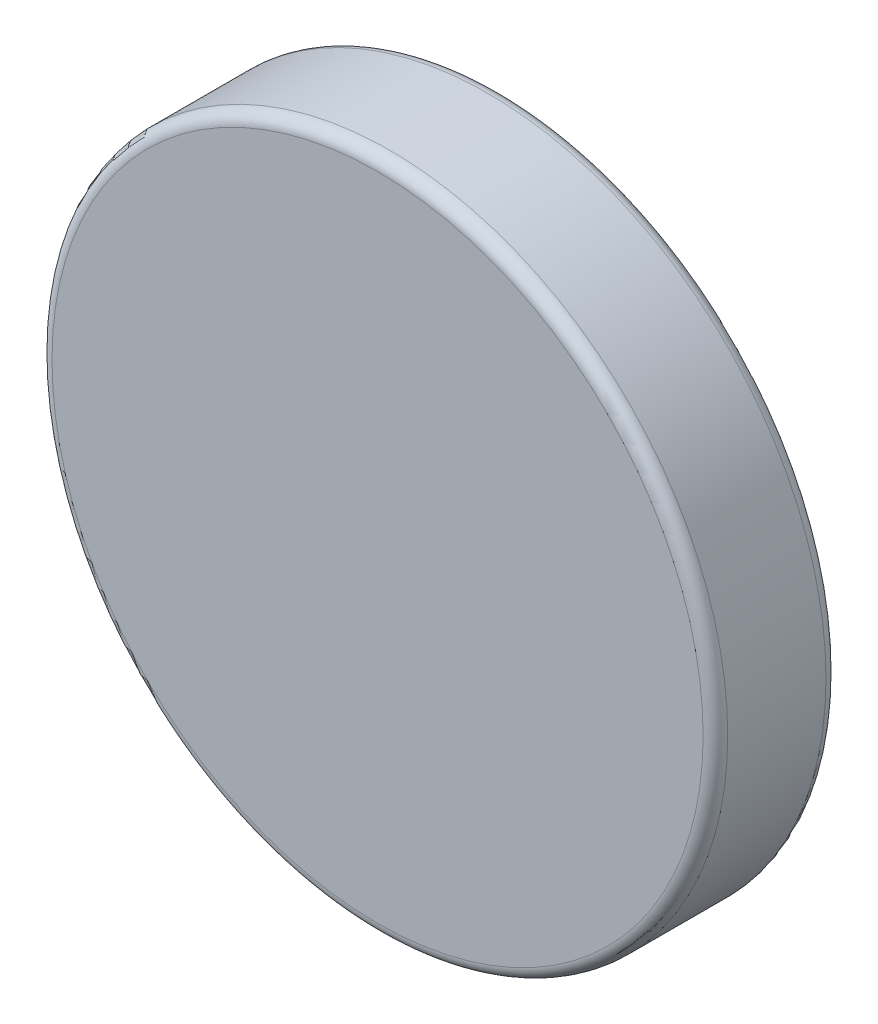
ISO-10303-21;
HEADER;
FILE_DESCRIPTION(('STEP AP214'),'2;1');
FILE_NAME('part.step','',(''),(''),'','','');
FILE_SCHEMA(('AUTOMOTIVE_DESIGN { 1 0 10303 214 1 1 1 1 }'));
ENDSEC;
DATA;
#1=APPLICATION_CONTEXT('core data for automotive mechanical design processes');
#2=APPLICATION_PROTOCOL_DEFINITION('international standard','automotive_design',2000,#1);
#3=PRODUCT_CONTEXT('',#1,'mechanical');
#4=PRODUCT('Part','Part','',(#3));
#5=PRODUCT_RELATED_PRODUCT_CATEGORY('part','',(#4));
#6=PRODUCT_DEFINITION_FORMATION('','',#4);
#7=PRODUCT_DEFINITION_CONTEXT('part definition',#1,'design');
#8=PRODUCT_DEFINITION('design','',#6,#7);
#9=PRODUCT_DEFINITION_SHAPE('','',#8);
#10=(LENGTH_UNIT() NAMED_UNIT(*) SI_UNIT(.MILLI.,.METRE.));
#11=(NAMED_UNIT(*) PLANE_ANGLE_UNIT() SI_UNIT($,.RADIAN.));
#12=(NAMED_UNIT(*) SI_UNIT($,.STERADIAN.) SOLID_ANGLE_UNIT());
#13=UNCERTAINTY_MEASURE_WITH_UNIT(LENGTH_MEASURE(1.E-05),#10,'distance_accuracy_value','');
#14=(GEOMETRIC_REPRESENTATION_CONTEXT(3) GLOBAL_UNCERTAINTY_ASSIGNED_CONTEXT((#13)) GLOBAL_UNIT_ASSIGNED_CONTEXT((#10,
#11,#12)) REPRESENTATION_CONTEXT('',''));
#15=CARTESIAN_POINT('',(0.,0.,0.));
#16=DIRECTION('',(0.,0.,1.));
#17=DIRECTION('',(1.,0.,0.));
#18=AXIS2_PLACEMENT_3D('',#15,#16,#17);
#19=CARTESIAN_POINT('',(0.,0.,1.));
#20=DIRECTION('',(0.,0.,-1.));
#21=DIRECTION('',(-1.,0.,0.));
#22=AXIS2_PLACEMENT_3D('',#19,#20,#21);
#23=CYLINDRICAL_SURFACE('',#22,2.75);
#24=CARTESIAN_POINT('',(0.,0.,0.9));
#25=DIRECTION('',(0.,0.,1.));
#26=DIRECTION('',(1.,0.,0.));
#27=AXIS2_PLACEMENT_3D('',#24,#25,#26);
#28=CIRCLE('',#27,2.75);
#29=CARTESIAN_POINT('',(2.75,0.,0.9));
#30=VERTEX_POINT('',#29);
#31=EDGE_CURVE('E10',#30,#30,#28,.F.);
#32=ORIENTED_EDGE('',*,*,#31,.T.);
#33=EDGE_LOOP('',(#32));
#34=FACE_BOUND('',#33,.T.);
#35=CARTESIAN_POINT('',(0.,0.,0.1));
#36=DIRECTION('',(0.,0.,1.));
#37=DIRECTION('',(1.,0.,0.));
#38=AXIS2_PLACEMENT_3D('',#35,#36,#37);
#39=CIRCLE('',#38,2.75);
#40=CARTESIAN_POINT('',(2.75,0.,0.1));
#41=VERTEX_POINT('',#40);
#42=EDGE_CURVE('E51',#41,#41,#39,.T.);
#43=ORIENTED_EDGE('',*,*,#42,.T.);
#44=EDGE_LOOP('',(#43));
#45=FACE_BOUND('',#44,.T.);
#46=ADVANCED_FACE('F43',(#34,#45),#23,.T.);
#47=CARTESIAN_POINT('',(0.,0.,1.));
#48=DIRECTION('',(0.,0.,1.));
#49=DIRECTION('',(1.,0.,0.));
#50=AXIS2_PLACEMENT_3D('',#47,#48,#49);
#51=PLANE('',#50);
#52=CARTESIAN_POINT('',(0.,0.,1.));
#53=DIRECTION('',(0.,0.,1.));
#54=DIRECTION('',(1.,0.,0.));
#55=AXIS2_PLACEMENT_3D('',#52,#53,#54);
#56=CIRCLE('',#55,2.65);
#57=CARTESIAN_POINT('',(2.65,0.,1.));
#58=VERTEX_POINT('',#57);
#59=EDGE_CURVE('E56',#58,#58,#56,.T.);
#60=ORIENTED_EDGE('',*,*,#59,.T.);
#61=EDGE_LOOP('',(#60));
#62=FACE_BOUND('',#61,.T.);
#63=ADVANCED_FACE('F94',(#62),#51,.T.);
#64=CARTESIAN_POINT('',(0.,0.,0.));
#65=DIRECTION('',(0.,0.,1.));
#66=DIRECTION('',(1.,0.,0.));
#67=AXIS2_PLACEMENT_3D('',#64,#65,#66);
#68=PLANE('',#67);
#69=CARTESIAN_POINT('',(0.,0.,0.));
#70=DIRECTION('',(0.,0.,1.));
#71=DIRECTION('',(1.,0.,0.));
#72=AXIS2_PLACEMENT_3D('',#69,#70,#71);
#73=CIRCLE('',#72,2.35);
#74=CARTESIAN_POINT('',(2.35,0.,0.));
#75=VERTEX_POINT('',#74);
#76=EDGE_CURVE('E61',#75,#75,#73,.T.);
#77=ORIENTED_EDGE('',*,*,#76,.T.);
#78=EDGE_LOOP('',(#77));
#79=FACE_BOUND('',#78,.T.);
#80=CARTESIAN_POINT('',(0.,0.,0.));
#81=DIRECTION('',(0.,0.,1.));
#82=DIRECTION('',(1.,0.,0.));
#83=AXIS2_PLACEMENT_3D('',#80,#81,#82);
#84=CIRCLE('',#83,2.65);
#85=CARTESIAN_POINT('',(2.65,0.,0.));
#86=VERTEX_POINT('',#85);
#87=EDGE_CURVE('E67',#86,#86,#84,.F.);
#88=ORIENTED_EDGE('',*,*,#87,.T.);
#89=EDGE_LOOP('',(#88));
#90=FACE_BOUND('',#89,.T.);
#91=ADVANCED_FACE('F84',(#79,#90),#68,.F.);
#92=CARTESIAN_POINT('',(0.,0.,0.8));
#93=DIRECTION('',(0.,0.,-1.));
#94=DIRECTION('',(-1.,0.,0.));
#95=AXIS2_PLACEMENT_3D('',#92,#93,#94);
#96=CYLINDRICAL_SURFACE('',#95,2.25);
#97=CARTESIAN_POINT('',(0.,0.,0.1));
#98=DIRECTION('',(0.,0.,1.));
#99=DIRECTION('',(1.,0.,0.));
#100=AXIS2_PLACEMENT_3D('',#97,#98,#99);
#101=CIRCLE('',#100,2.25);
#102=CARTESIAN_POINT('',(2.25,0.,0.1));
#103=VERTEX_POINT('',#102);
#104=EDGE_CURVE('E71',#103,#103,#101,.F.);
#105=ORIENTED_EDGE('',*,*,#104,.T.);
#106=EDGE_LOOP('',(#105));
#107=FACE_BOUND('',#106,.T.);
#108=CARTESIAN_POINT('',(0.,0.,0.8));
#109=DIRECTION('',(0.,0.,-1.));
#110=DIRECTION('',(-1.,0.,0.));
#111=AXIS2_PLACEMENT_3D('',#108,#109,#110);
#112=CIRCLE('',#111,2.25);
#113=CARTESIAN_POINT('',(-2.25,0.,0.8));
#114=VERTEX_POINT('',#113);
#115=EDGE_CURVE('E75',#114,#114,#112,.T.);
#116=ORIENTED_EDGE('',*,*,#115,.F.);
#117=EDGE_LOOP('',(#116));
#118=FACE_BOUND('',#117,.T.);
#119=ADVANCED_FACE('F82',(#107,#118),#96,.F.);
#120=CARTESIAN_POINT('',(0.,0.,0.8));
#121=DIRECTION('',(0.,0.,-1.));
#122=DIRECTION('',(-1.,0.,0.));
#123=AXIS2_PLACEMENT_3D('',#120,#121,#122);
#124=PLANE('',#123);
#125=ORIENTED_EDGE('',*,*,#115,.T.);
#126=EDGE_LOOP('',(#125));
#127=FACE_BOUND('',#126,.T.);
#128=ADVANCED_FACE('F80',(#127),#124,.T.);
#129=CARTESIAN_POINT('',(0.,0.,0.1));
#130=DIRECTION('',(0.,0.,1.));
#131=DIRECTION('',(1.,0.,0.));
#132=AXIS2_PLACEMENT_3D('',#129,#130,#131);
#133=TOROIDAL_SURFACE('',#132,2.35,0.1);
#134=ORIENTED_EDGE('',*,*,#76,.F.);
#135=EDGE_LOOP('',(#134));
#136=FACE_BOUND('',#135,.T.);
#137=ORIENTED_EDGE('',*,*,#104,.F.);
#138=EDGE_LOOP('',(#137));
#139=FACE_BOUND('',#138,.T.);
#140=ADVANCED_FACE('F92',(#136,#139),#133,.T.);
#141=CARTESIAN_POINT('',(0.,0.,0.9));
#142=DIRECTION('',(0.,0.,1.));
#143=DIRECTION('',(1.,0.,0.));
#144=AXIS2_PLACEMENT_3D('',#141,#142,#143);
#145=TOROIDAL_SURFACE('',#144,2.65,0.1);
#146=ORIENTED_EDGE('',*,*,#31,.F.);
#147=EDGE_LOOP('',(#146));
#148=FACE_BOUND('',#147,.T.);
#149=ORIENTED_EDGE('',*,*,#59,.F.);
#150=EDGE_LOOP('',(#149));
#151=FACE_BOUND('',#150,.T.);
#152=ADVANCED_FACE('F105',(#148,#151),#145,.T.);
#153=CARTESIAN_POINT('',(0.,0.,0.1));
#154=DIRECTION('',(0.,0.,1.));
#155=DIRECTION('',(1.,0.,0.));
#156=AXIS2_PLACEMENT_3D('',#153,#154,#155);
#157=TOROIDAL_SURFACE('',#156,2.65,0.1);
#158=ORIENTED_EDGE('',*,*,#87,.F.);
#159=EDGE_LOOP('',(#158));
#160=FACE_BOUND('',#159,.T.);
#161=ORIENTED_EDGE('',*,*,#42,.F.);
#162=EDGE_LOOP('',(#161));
#163=FACE_BOUND('',#162,.T.);
#164=ADVANCED_FACE('F45',(#160,#163),#157,.T.);
#165=CLOSED_SHELL('',(#46,#63,#91,#119,#128,#140,#152,#164));
#166=MANIFOLD_SOLID_BREP('B2',#165);
#167=ADVANCED_BREP_SHAPE_REPRESENTATION('',(#18,#166),#14);
#168=SHAPE_DEFINITION_REPRESENTATION(#9,#167);
ENDSEC;
END-ISO-10303-21;
